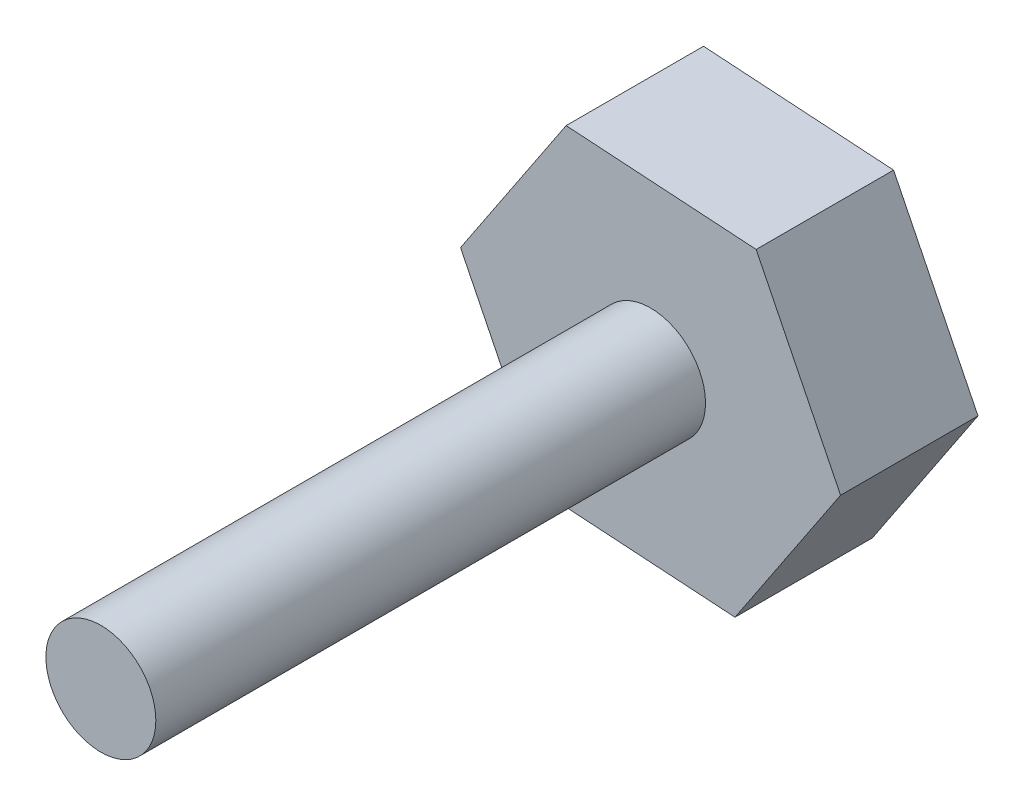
from build123d import *

# Parameters (mm, degrees)
BOSS_EXTRUDE1_DEPTH = 6.35
SKETCH2_R           = 2.54
BOSS_EXTRUDE2_DEPTH = 25.4


with BuildPart() as part:
    # Sketch1 → Boss-Extrude1 (new body)
    with BuildSketch(Plane.XY):
        Polygon((3.900992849, -7.886789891), (8.780656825, -0.565036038), (4.879663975, 7.321753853), (-3.900992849, 7.886789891), (-8.780656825, 0.565036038), (-4.879663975, -7.321753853), align=None)
    extrude(amount=BOSS_EXTRUDE1_DEPTH)

    # Sketch2 → Boss-Extrude2 (add)
    with BuildSketch(Plane.XY.offset(6.35)):
        Circle(SKETCH2_R)
    extrude(amount=BOSS_EXTRUDE2_DEPTH)


solid = part.part
